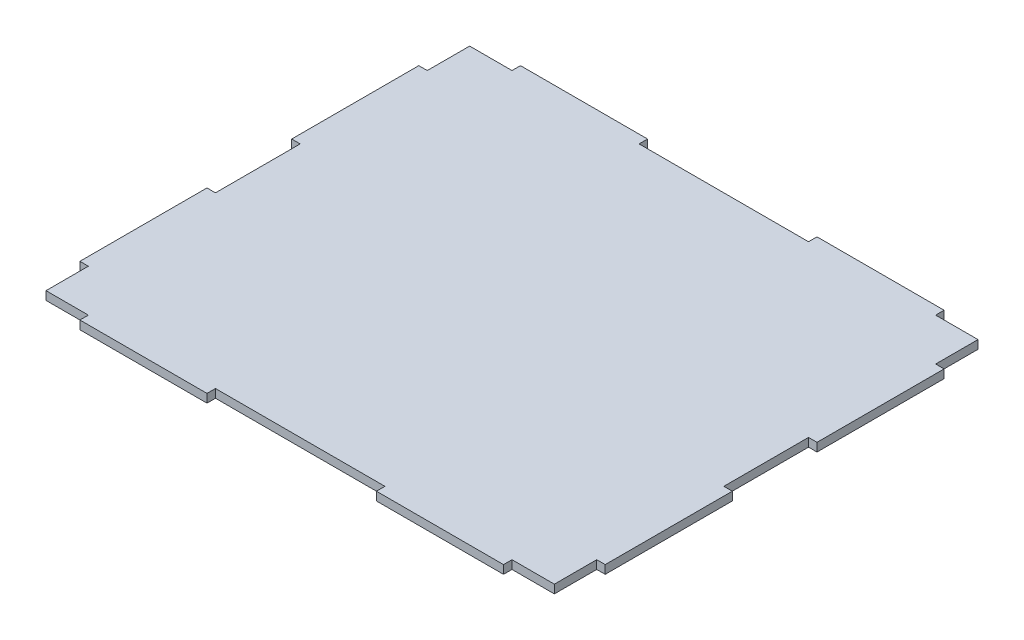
ISO-10303-21;
HEADER;
FILE_DESCRIPTION(('STEP AP214'),'2;1');
FILE_NAME('part.step','',(''),(''),'','','');
FILE_SCHEMA(('AUTOMOTIVE_DESIGN { 1 0 10303 214 1 1 1 1 }'));
ENDSEC;
DATA;
#1=APPLICATION_CONTEXT('core data for automotive mechanical design processes');
#2=APPLICATION_PROTOCOL_DEFINITION('international standard','automotive_design',2000,#1);
#3=PRODUCT_CONTEXT('',#1,'mechanical');
#4=PRODUCT('Part','Part','',(#3));
#5=PRODUCT_RELATED_PRODUCT_CATEGORY('part','',(#4));
#6=PRODUCT_DEFINITION_FORMATION('','',#4);
#7=PRODUCT_DEFINITION_CONTEXT('part definition',#1,'design');
#8=PRODUCT_DEFINITION('design','',#6,#7);
#9=PRODUCT_DEFINITION_SHAPE('','',#8);
#10=(LENGTH_UNIT() NAMED_UNIT(*) SI_UNIT(.MILLI.,.METRE.));
#11=(NAMED_UNIT(*) PLANE_ANGLE_UNIT() SI_UNIT($,.RADIAN.));
#12=(NAMED_UNIT(*) SI_UNIT($,.STERADIAN.) SOLID_ANGLE_UNIT());
#13=UNCERTAINTY_MEASURE_WITH_UNIT(LENGTH_MEASURE(1.E-05),#10,'distance_accuracy_value','');
#14=(GEOMETRIC_REPRESENTATION_CONTEXT(3) GLOBAL_UNCERTAINTY_ASSIGNED_CONTEXT((#13)) GLOBAL_UNIT_ASSIGNED_CONTEXT((#10,
#11,#12)) REPRESENTATION_CONTEXT('',''));
#15=CARTESIAN_POINT('',(0.,0.,0.));
#16=DIRECTION('',(0.,0.,1.));
#17=DIRECTION('',(1.,0.,0.));
#18=AXIS2_PLACEMENT_3D('',#15,#16,#17);
#19=CARTESIAN_POINT('',(600.,20.,-400.));
#20=DIRECTION('',(-1.,0.,0.));
#21=DIRECTION('',(0.,0.,1.));
#22=AXIS2_PLACEMENT_3D('',#19,#20,#21);
#23=PLANE('',#22);
#24=DIRECTION('',(0.,0.,-1.));
#25=VECTOR('',#24,1.);
#26=CARTESIAN_POINT('',(600.,0.,-400.));
#27=LINE('',#26,#25);
#28=CARTESIAN_POINT('',(600.,0.,-400.));
#29=VERTEX_POINT('',#28);
#30=CARTESIAN_POINT('',(600.,0.,-500.));
#31=VERTEX_POINT('',#30);
#32=EDGE_CURVE('E307',#29,#31,#27,.T.);
#33=ORIENTED_EDGE('',*,*,#32,.T.);
#34=DIRECTION('',(0.,-1.,0.));
#35=VECTOR('',#34,1.);
#36=CARTESIAN_POINT('',(600.,20.,-500.));
#37=LINE('',#36,#35);
#38=CARTESIAN_POINT('',(600.,20.,-500.));
#39=VERTEX_POINT('',#38);
#40=EDGE_CURVE('E11',#39,#31,#37,.T.);
#41=ORIENTED_EDGE('',*,*,#40,.F.);
#42=DIRECTION('',(0.,0.,-1.));
#43=VECTOR('',#42,1.);
#44=CARTESIAN_POINT('',(600.,20.,-400.));
#45=LINE('',#44,#43);
#46=CARTESIAN_POINT('',(600.,20.,-400.));
#47=VERTEX_POINT('',#46);
#48=EDGE_CURVE('E377',#47,#39,#45,.T.);
#49=ORIENTED_EDGE('',*,*,#48,.F.);
#50=DIRECTION('',(0.,-1.,0.));
#51=VECTOR('',#50,1.);
#52=CARTESIAN_POINT('',(600.,20.,-400.));
#53=LINE('',#52,#51);
#54=EDGE_CURVE('E303',#47,#29,#53,.T.);
#55=ORIENTED_EDGE('',*,*,#54,.T.);
#56=EDGE_LOOP('',(#33,#41,#49,#55));
#57=FACE_BOUND('',#56,.T.);
#58=ADVANCED_FACE('F43',(#57),#23,.F.);
#59=CARTESIAN_POINT('',(500.,20.,-500.));
#60=DIRECTION('',(0.,0.,1.));
#61=DIRECTION('',(1.,0.,0.));
#62=AXIS2_PLACEMENT_3D('',#59,#60,#61);
#63=PLANE('',#62);
#64=DIRECTION('',(-1.,0.,0.));
#65=VECTOR('',#64,1.);
#66=CARTESIAN_POINT('',(500.,0.,-500.));
#67=LINE('',#66,#65);
#68=CARTESIAN_POINT('',(500.,0.,-500.));
#69=VERTEX_POINT('',#68);
#70=EDGE_CURVE('E310',#31,#69,#67,.T.);
#71=ORIENTED_EDGE('',*,*,#70,.T.);
#72=DIRECTION('',(0.,-1.,0.));
#73=VECTOR('',#72,1.);
#74=CARTESIAN_POINT('',(500.,20.,-500.));
#75=LINE('',#74,#73);
#76=CARTESIAN_POINT('',(500.,20.,-500.));
#77=VERTEX_POINT('',#76);
#78=EDGE_CURVE('E51',#77,#69,#75,.T.);
#79=ORIENTED_EDGE('',*,*,#78,.F.);
#80=DIRECTION('',(-1.,0.,0.));
#81=VECTOR('',#80,1.);
#82=CARTESIAN_POINT('',(500.,20.,-500.));
#83=LINE('',#82,#81);
#84=EDGE_CURVE('E186',#39,#77,#83,.T.);
#85=ORIENTED_EDGE('',*,*,#84,.F.);
#86=ORIENTED_EDGE('',*,*,#40,.T.);
#87=EDGE_LOOP('',(#71,#79,#85,#86));
#88=FACE_BOUND('',#87,.T.);
#89=ADVANCED_FACE('F575',(#88),#63,.F.);
#90=CARTESIAN_POINT('',(500.,20.,-500.));
#91=DIRECTION('',(-1.,0.,0.));
#92=DIRECTION('',(0.,0.,1.));
#93=AXIS2_PLACEMENT_3D('',#90,#91,#92);
#94=PLANE('',#93);
#95=DIRECTION('',(0.,0.,-1.));
#96=VECTOR('',#95,1.);
#97=CARTESIAN_POINT('',(500.,0.,-500.));
#98=LINE('',#97,#96);
#99=CARTESIAN_POINT('',(500.,0.,-520.));
#100=VERTEX_POINT('',#99);
#101=EDGE_CURVE('E312',#69,#100,#98,.T.);
#102=ORIENTED_EDGE('',*,*,#101,.T.);
#103=DIRECTION('',(0.,-1.,0.));
#104=VECTOR('',#103,1.);
#105=CARTESIAN_POINT('',(500.,20.,-520.));
#106=LINE('',#105,#104);
#107=CARTESIAN_POINT('',(500.,20.,-520.));
#108=VERTEX_POINT('',#107);
#109=EDGE_CURVE('E468',#108,#100,#106,.T.);
#110=ORIENTED_EDGE('',*,*,#109,.F.);
#111=DIRECTION('',(0.,0.,-1.));
#112=VECTOR('',#111,1.);
#113=CARTESIAN_POINT('',(500.,20.,-500.));
#114=LINE('',#113,#112);
#115=EDGE_CURVE('E476',#77,#108,#114,.T.);
#116=ORIENTED_EDGE('',*,*,#115,.F.);
#117=ORIENTED_EDGE('',*,*,#78,.T.);
#118=EDGE_LOOP('',(#102,#110,#116,#117));
#119=FACE_BOUND('',#118,.T.);
#120=ADVANCED_FACE('F474',(#119),#94,.F.);
#121=CARTESIAN_POINT('',(200.,20.,-520.));
#122=DIRECTION('',(0.,0.,1.));
#123=DIRECTION('',(1.,0.,0.));
#124=AXIS2_PLACEMENT_3D('',#121,#122,#123);
#125=PLANE('',#124);
#126=DIRECTION('',(-1.,0.,0.));
#127=VECTOR('',#126,1.);
#128=CARTESIAN_POINT('',(200.,0.,-520.));
#129=LINE('',#128,#127);
#130=CARTESIAN_POINT('',(200.,0.,-520.));
#131=VERTEX_POINT('',#130);
#132=EDGE_CURVE('E314',#100,#131,#129,.T.);
#133=ORIENTED_EDGE('',*,*,#132,.T.);
#134=DIRECTION('',(0.,-1.,0.));
#135=VECTOR('',#134,1.);
#136=CARTESIAN_POINT('',(200.,20.,-520.));
#137=LINE('',#136,#135);
#138=CARTESIAN_POINT('',(200.,20.,-520.));
#139=VERTEX_POINT('',#138);
#140=EDGE_CURVE('E465',#139,#131,#137,.T.);
#141=ORIENTED_EDGE('',*,*,#140,.F.);
#142=DIRECTION('',(-1.,0.,0.));
#143=VECTOR('',#142,1.);
#144=CARTESIAN_POINT('',(200.,20.,-520.));
#145=LINE('',#144,#143);
#146=EDGE_CURVE('E494',#108,#139,#145,.T.);
#147=ORIENTED_EDGE('',*,*,#146,.F.);
#148=ORIENTED_EDGE('',*,*,#109,.T.);
#149=EDGE_LOOP('',(#133,#141,#147,#148));
#150=FACE_BOUND('',#149,.T.);
#151=ADVANCED_FACE('F485',(#150),#125,.F.);
#152=CARTESIAN_POINT('',(200.,20.,-500.));
#153=DIRECTION('',(1.,0.,0.));
#154=DIRECTION('',(0.,0.,-1.));
#155=AXIS2_PLACEMENT_3D('',#152,#153,#154);
#156=PLANE('',#155);
#157=DIRECTION('',(0.,0.,1.));
#158=VECTOR('',#157,1.);
#159=CARTESIAN_POINT('',(200.,0.,-500.));
#160=LINE('',#159,#158);
#161=CARTESIAN_POINT('',(200.,0.,-500.));
#162=VERTEX_POINT('',#161);
#163=EDGE_CURVE('E316',#131,#162,#160,.T.);
#164=ORIENTED_EDGE('',*,*,#163,.T.);
#165=DIRECTION('',(0.,-1.,0.));
#166=VECTOR('',#165,1.);
#167=CARTESIAN_POINT('',(200.,20.,-500.));
#168=LINE('',#167,#166);
#169=CARTESIAN_POINT('',(200.,20.,-500.));
#170=VERTEX_POINT('',#169);
#171=EDGE_CURVE('E462',#170,#162,#168,.T.);
#172=ORIENTED_EDGE('',*,*,#171,.F.);
#173=DIRECTION('',(0.,0.,1.));
#174=VECTOR('',#173,1.);
#175=CARTESIAN_POINT('',(200.,20.,-500.));
#176=LINE('',#175,#174);
#177=EDGE_CURVE('E491',#139,#170,#176,.T.);
#178=ORIENTED_EDGE('',*,*,#177,.F.);
#179=ORIENTED_EDGE('',*,*,#140,.T.);
#180=EDGE_LOOP('',(#164,#172,#178,#179));
#181=FACE_BOUND('',#180,.T.);
#182=ADVANCED_FACE('F489',(#181),#156,.F.);
#183=CARTESIAN_POINT('',(-200.,20.,-500.));
#184=DIRECTION('',(0.,0.,1.));
#185=DIRECTION('',(1.,0.,0.));
#186=AXIS2_PLACEMENT_3D('',#183,#184,#185);
#187=PLANE('',#186);
#188=DIRECTION('',(-1.,0.,0.));
#189=VECTOR('',#188,1.);
#190=CARTESIAN_POINT('',(-200.,0.,-500.));
#191=LINE('',#190,#189);
#192=CARTESIAN_POINT('',(-200.,0.,-500.));
#193=VERTEX_POINT('',#192);
#194=EDGE_CURVE('E318',#162,#193,#191,.T.);
#195=ORIENTED_EDGE('',*,*,#194,.T.);
#196=DIRECTION('',(0.,-1.,0.));
#197=VECTOR('',#196,1.);
#198=CARTESIAN_POINT('',(-200.,20.,-500.));
#199=LINE('',#198,#197);
#200=CARTESIAN_POINT('',(-200.,20.,-500.));
#201=VERTEX_POINT('',#200);
#202=EDGE_CURVE('E459',#201,#193,#199,.T.);
#203=ORIENTED_EDGE('',*,*,#202,.F.);
#204=DIRECTION('',(-1.,0.,0.));
#205=VECTOR('',#204,1.);
#206=CARTESIAN_POINT('',(-200.,20.,-500.));
#207=LINE('',#206,#205);
#208=EDGE_CURVE('E493',#170,#201,#207,.T.);
#209=ORIENTED_EDGE('',*,*,#208,.F.);
#210=ORIENTED_EDGE('',*,*,#171,.T.);
#211=EDGE_LOOP('',(#195,#203,#209,#210));
#212=FACE_BOUND('',#211,.T.);
#213=ADVANCED_FACE('F588',(#212),#187,.F.);
#214=CARTESIAN_POINT('',(-200.,20.,-500.));
#215=DIRECTION('',(-1.,0.,0.));
#216=DIRECTION('',(0.,0.,1.));
#217=AXIS2_PLACEMENT_3D('',#214,#215,#216);
#218=PLANE('',#217);
#219=DIRECTION('',(0.,0.,-1.));
#220=VECTOR('',#219,1.);
#221=CARTESIAN_POINT('',(-200.,0.,-500.));
#222=LINE('',#221,#220);
#223=CARTESIAN_POINT('',(-200.,0.,-520.));
#224=VERTEX_POINT('',#223);
#225=EDGE_CURVE('E320',#193,#224,#222,.T.);
#226=ORIENTED_EDGE('',*,*,#225,.T.);
#227=DIRECTION('',(0.,-1.,0.));
#228=VECTOR('',#227,1.);
#229=CARTESIAN_POINT('',(-200.,20.,-520.));
#230=LINE('',#229,#228);
#231=CARTESIAN_POINT('',(-200.,20.,-520.));
#232=VERTEX_POINT('',#231);
#233=EDGE_CURVE('E456',#232,#224,#230,.T.);
#234=ORIENTED_EDGE('',*,*,#233,.F.);
#235=DIRECTION('',(0.,0.,-1.));
#236=VECTOR('',#235,1.);
#237=CARTESIAN_POINT('',(-200.,20.,-500.));
#238=LINE('',#237,#236);
#239=EDGE_CURVE('E496',#201,#232,#238,.T.);
#240=ORIENTED_EDGE('',*,*,#239,.F.);
#241=ORIENTED_EDGE('',*,*,#202,.T.);
#242=EDGE_LOOP('',(#226,#234,#240,#241));
#243=FACE_BOUND('',#242,.T.);
#244=ADVANCED_FACE('F591',(#243),#218,.F.);
#245=CARTESIAN_POINT('',(-500.,20.,-520.));
#246=DIRECTION('',(0.,0.,1.));
#247=DIRECTION('',(1.,0.,0.));
#248=AXIS2_PLACEMENT_3D('',#245,#246,#247);
#249=PLANE('',#248);
#250=DIRECTION('',(-1.,0.,0.));
#251=VECTOR('',#250,1.);
#252=CARTESIAN_POINT('',(-500.,0.,-520.));
#253=LINE('',#252,#251);
#254=CARTESIAN_POINT('',(-500.,0.,-520.));
#255=VERTEX_POINT('',#254);
#256=EDGE_CURVE('E322',#224,#255,#253,.T.);
#257=ORIENTED_EDGE('',*,*,#256,.T.);
#258=DIRECTION('',(0.,-1.,0.));
#259=VECTOR('',#258,1.);
#260=CARTESIAN_POINT('',(-500.,20.,-520.));
#261=LINE('',#260,#259);
#262=CARTESIAN_POINT('',(-500.,20.,-520.));
#263=VERTEX_POINT('',#262);
#264=EDGE_CURVE('E453',#263,#255,#261,.T.);
#265=ORIENTED_EDGE('',*,*,#264,.F.);
#266=DIRECTION('',(-1.,0.,0.));
#267=VECTOR('',#266,1.);
#268=CARTESIAN_POINT('',(-500.,20.,-520.));
#269=LINE('',#268,#267);
#270=EDGE_CURVE('E502',#232,#263,#269,.T.);
#271=ORIENTED_EDGE('',*,*,#270,.F.);
#272=ORIENTED_EDGE('',*,*,#233,.T.);
#273=EDGE_LOOP('',(#257,#265,#271,#272));
#274=FACE_BOUND('',#273,.T.);
#275=ADVANCED_FACE('F595',(#274),#249,.F.);
#276=CARTESIAN_POINT('',(-500.,20.,-500.));
#277=DIRECTION('',(1.,0.,0.));
#278=DIRECTION('',(0.,0.,-1.));
#279=AXIS2_PLACEMENT_3D('',#276,#277,#278);
#280=PLANE('',#279);
#281=DIRECTION('',(0.,0.,1.));
#282=VECTOR('',#281,1.);
#283=CARTESIAN_POINT('',(-500.,0.,-500.));
#284=LINE('',#283,#282);
#285=CARTESIAN_POINT('',(-500.,0.,-500.));
#286=VERTEX_POINT('',#285);
#287=EDGE_CURVE('E324',#255,#286,#284,.T.);
#288=ORIENTED_EDGE('',*,*,#287,.T.);
#289=DIRECTION('',(0.,-1.,0.));
#290=VECTOR('',#289,1.);
#291=CARTESIAN_POINT('',(-500.,20.,-500.));
#292=LINE('',#291,#290);
#293=CARTESIAN_POINT('',(-500.,20.,-500.));
#294=VERTEX_POINT('',#293);
#295=EDGE_CURVE('E450',#294,#286,#292,.T.);
#296=ORIENTED_EDGE('',*,*,#295,.F.);
#297=DIRECTION('',(0.,0.,1.));
#298=VECTOR('',#297,1.);
#299=CARTESIAN_POINT('',(-500.,20.,-500.));
#300=LINE('',#299,#298);
#301=EDGE_CURVE('E504',#263,#294,#300,.T.);
#302=ORIENTED_EDGE('',*,*,#301,.F.);
#303=ORIENTED_EDGE('',*,*,#264,.T.);
#304=EDGE_LOOP('',(#288,#296,#302,#303));
#305=FACE_BOUND('',#304,.T.);
#306=ADVANCED_FACE('F599',(#305),#280,.F.);
#307=CARTESIAN_POINT('',(-600.,20.,-500.));
#308=DIRECTION('',(0.,0.,1.));
#309=DIRECTION('',(1.,0.,0.));
#310=AXIS2_PLACEMENT_3D('',#307,#308,#309);
#311=PLANE('',#310);
#312=DIRECTION('',(-1.,0.,0.));
#313=VECTOR('',#312,1.);
#314=CARTESIAN_POINT('',(-600.,0.,-500.));
#315=LINE('',#314,#313);
#316=CARTESIAN_POINT('',(-600.,0.,-500.));
#317=VERTEX_POINT('',#316);
#318=EDGE_CURVE('E326',#286,#317,#315,.T.);
#319=ORIENTED_EDGE('',*,*,#318,.T.);
#320=DIRECTION('',(0.,-1.,0.));
#321=VECTOR('',#320,1.);
#322=CARTESIAN_POINT('',(-600.,20.,-500.));
#323=LINE('',#322,#321);
#324=CARTESIAN_POINT('',(-600.,20.,-500.));
#325=VERTEX_POINT('',#324);
#326=EDGE_CURVE('E447',#325,#317,#323,.T.);
#327=ORIENTED_EDGE('',*,*,#326,.F.);
#328=DIRECTION('',(-1.,0.,0.));
#329=VECTOR('',#328,1.);
#330=CARTESIAN_POINT('',(-600.,20.,-500.));
#331=LINE('',#330,#329);
#332=EDGE_CURVE('E506',#294,#325,#331,.T.);
#333=ORIENTED_EDGE('',*,*,#332,.F.);
#334=ORIENTED_EDGE('',*,*,#295,.T.);
#335=EDGE_LOOP('',(#319,#327,#333,#334));
#336=FACE_BOUND('',#335,.T.);
#337=ADVANCED_FACE('F603',(#336),#311,.F.);
#338=CARTESIAN_POINT('',(-600.,20.,-400.));
#339=DIRECTION('',(1.,0.,0.));
#340=DIRECTION('',(0.,0.,-1.));
#341=AXIS2_PLACEMENT_3D('',#338,#339,#340);
#342=PLANE('',#341);
#343=DIRECTION('',(0.,0.,1.));
#344=VECTOR('',#343,1.);
#345=CARTESIAN_POINT('',(-600.,0.,-400.));
#346=LINE('',#345,#344);
#347=CARTESIAN_POINT('',(-600.,0.,-400.));
#348=VERTEX_POINT('',#347);
#349=EDGE_CURVE('E328',#317,#348,#346,.T.);
#350=ORIENTED_EDGE('',*,*,#349,.T.);
#351=DIRECTION('',(0.,-1.,0.));
#352=VECTOR('',#351,1.);
#353=CARTESIAN_POINT('',(-600.,20.,-400.));
#354=LINE('',#353,#352);
#355=CARTESIAN_POINT('',(-600.,20.,-400.));
#356=VERTEX_POINT('',#355);
#357=EDGE_CURVE('E444',#356,#348,#354,.T.);
#358=ORIENTED_EDGE('',*,*,#357,.F.);
#359=DIRECTION('',(0.,0.,1.));
#360=VECTOR('',#359,1.);
#361=CARTESIAN_POINT('',(-600.,20.,-400.));
#362=LINE('',#361,#360);
#363=EDGE_CURVE('E508',#325,#356,#362,.T.);
#364=ORIENTED_EDGE('',*,*,#363,.F.);
#365=ORIENTED_EDGE('',*,*,#326,.T.);
#366=EDGE_LOOP('',(#350,#358,#364,#365));
#367=FACE_BOUND('',#366,.T.);
#368=ADVANCED_FACE('F607',(#367),#342,.F.);
#369=CARTESIAN_POINT('',(-600.,20.,-400.));
#370=DIRECTION('',(0.,0.,1.));
#371=DIRECTION('',(1.,0.,0.));
#372=AXIS2_PLACEMENT_3D('',#369,#370,#371);
#373=PLANE('',#372);
#374=DIRECTION('',(-1.,0.,0.));
#375=VECTOR('',#374,1.);
#376=CARTESIAN_POINT('',(-600.,0.,-400.));
#377=LINE('',#376,#375);
#378=CARTESIAN_POINT('',(-620.,0.,-400.));
#379=VERTEX_POINT('',#378);
#380=EDGE_CURVE('E330',#348,#379,#377,.T.);
#381=ORIENTED_EDGE('',*,*,#380,.T.);
#382=DIRECTION('',(0.,-1.,0.));
#383=VECTOR('',#382,1.);
#384=CARTESIAN_POINT('',(-620.,20.,-400.));
#385=LINE('',#384,#383);
#386=CARTESIAN_POINT('',(-620.,20.,-400.));
#387=VERTEX_POINT('',#386);
#388=EDGE_CURVE('E441',#387,#379,#385,.T.);
#389=ORIENTED_EDGE('',*,*,#388,.F.);
#390=DIRECTION('',(-1.,0.,0.));
#391=VECTOR('',#390,1.);
#392=CARTESIAN_POINT('',(-600.,20.,-400.));
#393=LINE('',#392,#391);
#394=EDGE_CURVE('E510',#356,#387,#393,.T.);
#395=ORIENTED_EDGE('',*,*,#394,.F.);
#396=ORIENTED_EDGE('',*,*,#357,.T.);
#397=EDGE_LOOP('',(#381,#389,#395,#396));
#398=FACE_BOUND('',#397,.T.);
#399=ADVANCED_FACE('F611',(#398),#373,.F.);
#400=CARTESIAN_POINT('',(-620.,20.,-400.));
#401=DIRECTION('',(1.,0.,0.));
#402=DIRECTION('',(0.,0.,-1.));
#403=AXIS2_PLACEMENT_3D('',#400,#401,#402);
#404=PLANE('',#403);
#405=DIRECTION('',(0.,0.,1.));
#406=VECTOR('',#405,1.);
#407=CARTESIAN_POINT('',(-620.,0.,-400.));
#408=LINE('',#407,#406);
#409=CARTESIAN_POINT('',(-620.,0.,-100.));
#410=VERTEX_POINT('',#409);
#411=EDGE_CURVE('E332',#379,#410,#408,.T.);
#412=ORIENTED_EDGE('',*,*,#411,.T.);
#413=DIRECTION('',(0.,-1.,0.));
#414=VECTOR('',#413,1.);
#415=CARTESIAN_POINT('',(-620.,20.,-100.));
#416=LINE('',#415,#414);
#417=CARTESIAN_POINT('',(-620.,20.,-100.));
#418=VERTEX_POINT('',#417);
#419=EDGE_CURVE('E438',#418,#410,#416,.T.);
#420=ORIENTED_EDGE('',*,*,#419,.F.);
#421=DIRECTION('',(0.,0.,1.));
#422=VECTOR('',#421,1.);
#423=CARTESIAN_POINT('',(-620.,20.,-400.));
#424=LINE('',#423,#422);
#425=EDGE_CURVE('E512',#387,#418,#424,.T.);
#426=ORIENTED_EDGE('',*,*,#425,.F.);
#427=ORIENTED_EDGE('',*,*,#388,.T.);
#428=EDGE_LOOP('',(#412,#420,#426,#427));
#429=FACE_BOUND('',#428,.T.);
#430=ADVANCED_FACE('F615',(#429),#404,.F.);
#431=CARTESIAN_POINT('',(-600.,20.,-100.));
#432=DIRECTION('',(0.,0.,-1.));
#433=DIRECTION('',(-1.,0.,0.));
#434=AXIS2_PLACEMENT_3D('',#431,#432,#433);
#435=PLANE('',#434);
#436=DIRECTION('',(1.,0.,0.));
#437=VECTOR('',#436,1.);
#438=CARTESIAN_POINT('',(-600.,0.,-100.));
#439=LINE('',#438,#437);
#440=CARTESIAN_POINT('',(-600.,0.,-100.));
#441=VERTEX_POINT('',#440);
#442=EDGE_CURVE('E334',#410,#441,#439,.T.);
#443=ORIENTED_EDGE('',*,*,#442,.T.);
#444=DIRECTION('',(0.,-1.,0.));
#445=VECTOR('',#444,1.);
#446=CARTESIAN_POINT('',(-600.,20.,-100.));
#447=LINE('',#446,#445);
#448=CARTESIAN_POINT('',(-600.,20.,-100.));
#449=VERTEX_POINT('',#448);
#450=EDGE_CURVE('E435',#449,#441,#447,.T.);
#451=ORIENTED_EDGE('',*,*,#450,.F.);
#452=DIRECTION('',(1.,0.,0.));
#453=VECTOR('',#452,1.);
#454=CARTESIAN_POINT('',(-600.,20.,-100.));
#455=LINE('',#454,#453);
#456=EDGE_CURVE('E514',#418,#449,#455,.T.);
#457=ORIENTED_EDGE('',*,*,#456,.F.);
#458=ORIENTED_EDGE('',*,*,#419,.T.);
#459=EDGE_LOOP('',(#443,#451,#457,#458));
#460=FACE_BOUND('',#459,.T.);
#461=ADVANCED_FACE('F619',(#460),#435,.F.);
#462=CARTESIAN_POINT('',(-600.,20.,100.));
#463=DIRECTION('',(1.,0.,0.));
#464=DIRECTION('',(0.,0.,-1.));
#465=AXIS2_PLACEMENT_3D('',#462,#463,#464);
#466=PLANE('',#465);
#467=DIRECTION('',(0.,0.,1.));
#468=VECTOR('',#467,1.);
#469=CARTESIAN_POINT('',(-600.,0.,100.));
#470=LINE('',#469,#468);
#471=CARTESIAN_POINT('',(-600.,0.,100.));
#472=VERTEX_POINT('',#471);
#473=EDGE_CURVE('E336',#441,#472,#470,.T.);
#474=ORIENTED_EDGE('',*,*,#473,.T.);
#475=DIRECTION('',(0.,-1.,0.));
#476=VECTOR('',#475,1.);
#477=CARTESIAN_POINT('',(-600.,20.,100.));
#478=LINE('',#477,#476);
#479=CARTESIAN_POINT('',(-600.,20.,100.));
#480=VERTEX_POINT('',#479);
#481=EDGE_CURVE('E432',#480,#472,#478,.T.);
#482=ORIENTED_EDGE('',*,*,#481,.F.);
#483=DIRECTION('',(0.,0.,1.));
#484=VECTOR('',#483,1.);
#485=CARTESIAN_POINT('',(-600.,20.,100.));
#486=LINE('',#485,#484);
#487=EDGE_CURVE('E516',#449,#480,#486,.T.);
#488=ORIENTED_EDGE('',*,*,#487,.F.);
#489=ORIENTED_EDGE('',*,*,#450,.T.);
#490=EDGE_LOOP('',(#474,#482,#488,#489));
#491=FACE_BOUND('',#490,.T.);
#492=ADVANCED_FACE('F623',(#491),#466,.F.);
#493=CARTESIAN_POINT('',(-600.,20.,100.));
#494=DIRECTION('',(0.,0.,1.));
#495=DIRECTION('',(1.,0.,0.));
#496=AXIS2_PLACEMENT_3D('',#493,#494,#495);
#497=PLANE('',#496);
#498=DIRECTION('',(-1.,0.,0.));
#499=VECTOR('',#498,1.);
#500=CARTESIAN_POINT('',(-600.,0.,100.));
#501=LINE('',#500,#499);
#502=CARTESIAN_POINT('',(-620.,0.,100.));
#503=VERTEX_POINT('',#502);
#504=EDGE_CURVE('E338',#472,#503,#501,.T.);
#505=ORIENTED_EDGE('',*,*,#504,.T.);
#506=DIRECTION('',(0.,-1.,0.));
#507=VECTOR('',#506,1.);
#508=CARTESIAN_POINT('',(-620.,20.,100.));
#509=LINE('',#508,#507);
#510=CARTESIAN_POINT('',(-620.,20.,100.));
#511=VERTEX_POINT('',#510);
#512=EDGE_CURVE('E429',#511,#503,#509,.T.);
#513=ORIENTED_EDGE('',*,*,#512,.F.);
#514=DIRECTION('',(-1.,0.,0.));
#515=VECTOR('',#514,1.);
#516=CARTESIAN_POINT('',(-600.,20.,100.));
#517=LINE('',#516,#515);
#518=EDGE_CURVE('E518',#480,#511,#517,.T.);
#519=ORIENTED_EDGE('',*,*,#518,.F.);
#520=ORIENTED_EDGE('',*,*,#481,.T.);
#521=EDGE_LOOP('',(#505,#513,#519,#520));
#522=FACE_BOUND('',#521,.T.);
#523=ADVANCED_FACE('F627',(#522),#497,.F.);
#524=CARTESIAN_POINT('',(-620.,20.,100.));
#525=DIRECTION('',(1.,0.,0.));
#526=DIRECTION('',(0.,0.,-1.));
#527=AXIS2_PLACEMENT_3D('',#524,#525,#526);
#528=PLANE('',#527);
#529=DIRECTION('',(0.,0.,1.));
#530=VECTOR('',#529,1.);
#531=CARTESIAN_POINT('',(-620.,0.,100.));
#532=LINE('',#531,#530);
#533=CARTESIAN_POINT('',(-620.,0.,400.));
#534=VERTEX_POINT('',#533);
#535=EDGE_CURVE('E340',#503,#534,#532,.T.);
#536=ORIENTED_EDGE('',*,*,#535,.T.);
#537=DIRECTION('',(0.,-1.,0.));
#538=VECTOR('',#537,1.);
#539=CARTESIAN_POINT('',(-620.,20.,400.));
#540=LINE('',#539,#538);
#541=CARTESIAN_POINT('',(-620.,20.,400.));
#542=VERTEX_POINT('',#541);
#543=EDGE_CURVE('E426',#542,#534,#540,.T.);
#544=ORIENTED_EDGE('',*,*,#543,.F.);
#545=DIRECTION('',(0.,0.,1.));
#546=VECTOR('',#545,1.);
#547=CARTESIAN_POINT('',(-620.,20.,100.));
#548=LINE('',#547,#546);
#549=EDGE_CURVE('E520',#511,#542,#548,.T.);
#550=ORIENTED_EDGE('',*,*,#549,.F.);
#551=ORIENTED_EDGE('',*,*,#512,.T.);
#552=EDGE_LOOP('',(#536,#544,#550,#551));
#553=FACE_BOUND('',#552,.T.);
#554=ADVANCED_FACE('F631',(#553),#528,.F.);
#555=CARTESIAN_POINT('',(-600.,20.,400.));
#556=DIRECTION('',(0.,0.,-1.));
#557=DIRECTION('',(-1.,0.,0.));
#558=AXIS2_PLACEMENT_3D('',#555,#556,#557);
#559=PLANE('',#558);
#560=DIRECTION('',(1.,0.,0.));
#561=VECTOR('',#560,1.);
#562=CARTESIAN_POINT('',(-600.,0.,400.));
#563=LINE('',#562,#561);
#564=CARTESIAN_POINT('',(-600.,0.,400.));
#565=VERTEX_POINT('',#564);
#566=EDGE_CURVE('E342',#534,#565,#563,.T.);
#567=ORIENTED_EDGE('',*,*,#566,.T.);
#568=DIRECTION('',(0.,-1.,0.));
#569=VECTOR('',#568,1.);
#570=CARTESIAN_POINT('',(-600.,20.,400.));
#571=LINE('',#570,#569);
#572=CARTESIAN_POINT('',(-600.,20.,400.));
#573=VERTEX_POINT('',#572);
#574=EDGE_CURVE('E423',#573,#565,#571,.T.);
#575=ORIENTED_EDGE('',*,*,#574,.F.);
#576=DIRECTION('',(1.,0.,0.));
#577=VECTOR('',#576,1.);
#578=CARTESIAN_POINT('',(-600.,20.,400.));
#579=LINE('',#578,#577);
#580=EDGE_CURVE('E522',#542,#573,#579,.T.);
#581=ORIENTED_EDGE('',*,*,#580,.F.);
#582=ORIENTED_EDGE('',*,*,#543,.T.);
#583=EDGE_LOOP('',(#567,#575,#581,#582));
#584=FACE_BOUND('',#583,.T.);
#585=ADVANCED_FACE('F635',(#584),#559,.F.);
#586=CARTESIAN_POINT('',(-600.,20.,500.));
#587=DIRECTION('',(1.,0.,0.));
#588=DIRECTION('',(0.,0.,-1.));
#589=AXIS2_PLACEMENT_3D('',#586,#587,#588);
#590=PLANE('',#589);
#591=DIRECTION('',(0.,0.,1.));
#592=VECTOR('',#591,1.);
#593=CARTESIAN_POINT('',(-600.,0.,500.));
#594=LINE('',#593,#592);
#595=CARTESIAN_POINT('',(-600.,0.,500.));
#596=VERTEX_POINT('',#595);
#597=EDGE_CURVE('E344',#565,#596,#594,.T.);
#598=ORIENTED_EDGE('',*,*,#597,.T.);
#599=DIRECTION('',(0.,-1.,0.));
#600=VECTOR('',#599,1.);
#601=CARTESIAN_POINT('',(-600.,20.,500.));
#602=LINE('',#601,#600);
#603=CARTESIAN_POINT('',(-600.,20.,500.));
#604=VERTEX_POINT('',#603);
#605=EDGE_CURVE('E420',#604,#596,#602,.T.);
#606=ORIENTED_EDGE('',*,*,#605,.F.);
#607=DIRECTION('',(0.,0.,1.));
#608=VECTOR('',#607,1.);
#609=CARTESIAN_POINT('',(-600.,20.,500.));
#610=LINE('',#609,#608);
#611=EDGE_CURVE('E524',#573,#604,#610,.T.);
#612=ORIENTED_EDGE('',*,*,#611,.F.);
#613=ORIENTED_EDGE('',*,*,#574,.T.);
#614=EDGE_LOOP('',(#598,#606,#612,#613));
#615=FACE_BOUND('',#614,.T.);
#616=ADVANCED_FACE('F639',(#615),#590,.F.);
#617=CARTESIAN_POINT('',(-600.,20.,500.));
#618=DIRECTION('',(0.,0.,-1.));
#619=DIRECTION('',(-1.,0.,0.));
#620=AXIS2_PLACEMENT_3D('',#617,#618,#619);
#621=PLANE('',#620);
#622=DIRECTION('',(1.,0.,0.));
#623=VECTOR('',#622,1.);
#624=CARTESIAN_POINT('',(-600.,0.,500.));
#625=LINE('',#624,#623);
#626=CARTESIAN_POINT('',(-500.,0.,500.));
#627=VERTEX_POINT('',#626);
#628=EDGE_CURVE('E346',#596,#627,#625,.T.);
#629=ORIENTED_EDGE('',*,*,#628,.T.);
#630=DIRECTION('',(0.,-1.,0.));
#631=VECTOR('',#630,1.);
#632=CARTESIAN_POINT('',(-500.,20.,500.));
#633=LINE('',#632,#631);
#634=CARTESIAN_POINT('',(-500.,20.,500.));
#635=VERTEX_POINT('',#634);
#636=EDGE_CURVE('E417',#635,#627,#633,.T.);
#637=ORIENTED_EDGE('',*,*,#636,.F.);
#638=DIRECTION('',(1.,0.,0.));
#639=VECTOR('',#638,1.);
#640=CARTESIAN_POINT('',(-600.,20.,500.));
#641=LINE('',#640,#639);
#642=EDGE_CURVE('E526',#604,#635,#641,.T.);
#643=ORIENTED_EDGE('',*,*,#642,.F.);
#644=ORIENTED_EDGE('',*,*,#605,.T.);
#645=EDGE_LOOP('',(#629,#637,#643,#644));
#646=FACE_BOUND('',#645,.T.);
#647=ADVANCED_FACE('F643',(#646),#621,.F.);
#648=CARTESIAN_POINT('',(-500.,20.,500.));
#649=DIRECTION('',(1.,0.,0.));
#650=DIRECTION('',(0.,0.,-1.));
#651=AXIS2_PLACEMENT_3D('',#648,#649,#650);
#652=PLANE('',#651);
#653=DIRECTION('',(0.,0.,1.));
#654=VECTOR('',#653,1.);
#655=CARTESIAN_POINT('',(-500.,0.,500.));
#656=LINE('',#655,#654);
#657=CARTESIAN_POINT('',(-500.,0.,520.));
#658=VERTEX_POINT('',#657);
#659=EDGE_CURVE('E348',#627,#658,#656,.T.);
#660=ORIENTED_EDGE('',*,*,#659,.T.);
#661=DIRECTION('',(0.,-1.,0.));
#662=VECTOR('',#661,1.);
#663=CARTESIAN_POINT('',(-500.,20.,520.));
#664=LINE('',#663,#662);
#665=CARTESIAN_POINT('',(-500.,20.,520.));
#666=VERTEX_POINT('',#665);
#667=EDGE_CURVE('E414',#666,#658,#664,.T.);
#668=ORIENTED_EDGE('',*,*,#667,.F.);
#669=DIRECTION('',(0.,0.,1.));
#670=VECTOR('',#669,1.);
#671=CARTESIAN_POINT('',(-500.,20.,500.));
#672=LINE('',#671,#670);
#673=EDGE_CURVE('E528',#635,#666,#672,.T.);
#674=ORIENTED_EDGE('',*,*,#673,.F.);
#675=ORIENTED_EDGE('',*,*,#636,.T.);
#676=EDGE_LOOP('',(#660,#668,#674,#675));
#677=FACE_BOUND('',#676,.T.);
#678=ADVANCED_FACE('F647',(#677),#652,.F.);
#679=CARTESIAN_POINT('',(-500.,20.,520.));
#680=DIRECTION('',(0.,0.,-1.));
#681=DIRECTION('',(-1.,0.,0.));
#682=AXIS2_PLACEMENT_3D('',#679,#680,#681);
#683=PLANE('',#682);
#684=DIRECTION('',(1.,0.,0.));
#685=VECTOR('',#684,1.);
#686=CARTESIAN_POINT('',(-500.,0.,520.));
#687=LINE('',#686,#685);
#688=CARTESIAN_POINT('',(-200.,0.,520.));
#689=VERTEX_POINT('',#688);
#690=EDGE_CURVE('E350',#658,#689,#687,.T.);
#691=ORIENTED_EDGE('',*,*,#690,.T.);
#692=DIRECTION('',(0.,-1.,0.));
#693=VECTOR('',#692,1.);
#694=CARTESIAN_POINT('',(-200.,20.,520.));
#695=LINE('',#694,#693);
#696=CARTESIAN_POINT('',(-200.,20.,520.));
#697=VERTEX_POINT('',#696);
#698=EDGE_CURVE('E411',#697,#689,#695,.T.);
#699=ORIENTED_EDGE('',*,*,#698,.F.);
#700=DIRECTION('',(1.,0.,0.));
#701=VECTOR('',#700,1.);
#702=CARTESIAN_POINT('',(-500.,20.,520.));
#703=LINE('',#702,#701);
#704=EDGE_CURVE('E530',#666,#697,#703,.T.);
#705=ORIENTED_EDGE('',*,*,#704,.F.);
#706=ORIENTED_EDGE('',*,*,#667,.T.);
#707=EDGE_LOOP('',(#691,#699,#705,#706));
#708=FACE_BOUND('',#707,.T.);
#709=ADVANCED_FACE('F651',(#708),#683,.F.);
#710=CARTESIAN_POINT('',(-200.,20.,500.));
#711=DIRECTION('',(-1.,0.,0.));
#712=DIRECTION('',(0.,0.,1.));
#713=AXIS2_PLACEMENT_3D('',#710,#711,#712);
#714=PLANE('',#713);
#715=DIRECTION('',(0.,0.,-1.));
#716=VECTOR('',#715,1.);
#717=CARTESIAN_POINT('',(-200.,0.,500.));
#718=LINE('',#717,#716);
#719=CARTESIAN_POINT('',(-200.,0.,500.));
#720=VERTEX_POINT('',#719);
#721=EDGE_CURVE('E352',#689,#720,#718,.T.);
#722=ORIENTED_EDGE('',*,*,#721,.T.);
#723=DIRECTION('',(0.,-1.,0.));
#724=VECTOR('',#723,1.);
#725=CARTESIAN_POINT('',(-200.,20.,500.));
#726=LINE('',#725,#724);
#727=CARTESIAN_POINT('',(-200.,20.,500.));
#728=VERTEX_POINT('',#727);
#729=EDGE_CURVE('E408',#728,#720,#726,.T.);
#730=ORIENTED_EDGE('',*,*,#729,.F.);
#731=DIRECTION('',(0.,0.,-1.));
#732=VECTOR('',#731,1.);
#733=CARTESIAN_POINT('',(-200.,20.,500.));
#734=LINE('',#733,#732);
#735=EDGE_CURVE('E532',#697,#728,#734,.T.);
#736=ORIENTED_EDGE('',*,*,#735,.F.);
#737=ORIENTED_EDGE('',*,*,#698,.T.);
#738=EDGE_LOOP('',(#722,#730,#736,#737));
#739=FACE_BOUND('',#738,.T.);
#740=ADVANCED_FACE('F655',(#739),#714,.F.);
#741=CARTESIAN_POINT('',(-200.,20.,500.));
#742=DIRECTION('',(0.,0.,-1.));
#743=DIRECTION('',(-1.,0.,0.));
#744=AXIS2_PLACEMENT_3D('',#741,#742,#743);
#745=PLANE('',#744);
#746=DIRECTION('',(1.,0.,0.));
#747=VECTOR('',#746,1.);
#748=CARTESIAN_POINT('',(-200.,0.,500.));
#749=LINE('',#748,#747);
#750=CARTESIAN_POINT('',(200.,0.,500.));
#751=VERTEX_POINT('',#750);
#752=EDGE_CURVE('E354',#720,#751,#749,.T.);
#753=ORIENTED_EDGE('',*,*,#752,.T.);
#754=DIRECTION('',(0.,-1.,0.));
#755=VECTOR('',#754,1.);
#756=CARTESIAN_POINT('',(200.,20.,500.));
#757=LINE('',#756,#755);
#758=CARTESIAN_POINT('',(200.,20.,500.));
#759=VERTEX_POINT('',#758);
#760=EDGE_CURVE('E405',#759,#751,#757,.T.);
#761=ORIENTED_EDGE('',*,*,#760,.F.);
#762=DIRECTION('',(1.,0.,0.));
#763=VECTOR('',#762,1.);
#764=CARTESIAN_POINT('',(-200.,20.,500.));
#765=LINE('',#764,#763);
#766=EDGE_CURVE('E534',#728,#759,#765,.T.);
#767=ORIENTED_EDGE('',*,*,#766,.F.);
#768=ORIENTED_EDGE('',*,*,#729,.T.);
#769=EDGE_LOOP('',(#753,#761,#767,#768));
#770=FACE_BOUND('',#769,.T.);
#771=ADVANCED_FACE('F659',(#770),#745,.F.);
#772=CARTESIAN_POINT('',(200.,20.,500.));
#773=DIRECTION('',(1.,0.,0.));
#774=DIRECTION('',(0.,0.,-1.));
#775=AXIS2_PLACEMENT_3D('',#772,#773,#774);
#776=PLANE('',#775);
#777=DIRECTION('',(0.,0.,1.));
#778=VECTOR('',#777,1.);
#779=CARTESIAN_POINT('',(200.,0.,500.));
#780=LINE('',#779,#778);
#781=CARTESIAN_POINT('',(200.,0.,520.));
#782=VERTEX_POINT('',#781);
#783=EDGE_CURVE('E356',#751,#782,#780,.T.);
#784=ORIENTED_EDGE('',*,*,#783,.T.);
#785=DIRECTION('',(0.,-1.,0.));
#786=VECTOR('',#785,1.);
#787=CARTESIAN_POINT('',(200.,20.,520.));
#788=LINE('',#787,#786);
#789=CARTESIAN_POINT('',(200.,20.,520.));
#790=VERTEX_POINT('',#789);
#791=EDGE_CURVE('E402',#790,#782,#788,.T.);
#792=ORIENTED_EDGE('',*,*,#791,.F.);
#793=DIRECTION('',(0.,0.,1.));
#794=VECTOR('',#793,1.);
#795=CARTESIAN_POINT('',(200.,20.,500.));
#796=LINE('',#795,#794);
#797=EDGE_CURVE('E536',#759,#790,#796,.T.);
#798=ORIENTED_EDGE('',*,*,#797,.F.);
#799=ORIENTED_EDGE('',*,*,#760,.T.);
#800=EDGE_LOOP('',(#784,#792,#798,#799));
#801=FACE_BOUND('',#800,.T.);
#802=ADVANCED_FACE('F663',(#801),#776,.F.);
#803=CARTESIAN_POINT('',(200.,20.,520.));
#804=DIRECTION('',(0.,0.,-1.));
#805=DIRECTION('',(-1.,0.,0.));
#806=AXIS2_PLACEMENT_3D('',#803,#804,#805);
#807=PLANE('',#806);
#808=DIRECTION('',(1.,0.,0.));
#809=VECTOR('',#808,1.);
#810=CARTESIAN_POINT('',(200.,0.,520.));
#811=LINE('',#810,#809);
#812=CARTESIAN_POINT('',(500.,0.,520.));
#813=VERTEX_POINT('',#812);
#814=EDGE_CURVE('E358',#782,#813,#811,.T.);
#815=ORIENTED_EDGE('',*,*,#814,.T.);
#816=DIRECTION('',(0.,-1.,0.));
#817=VECTOR('',#816,1.);
#818=CARTESIAN_POINT('',(500.,20.,520.));
#819=LINE('',#818,#817);
#820=CARTESIAN_POINT('',(500.,20.,520.));
#821=VERTEX_POINT('',#820);
#822=EDGE_CURVE('E399',#821,#813,#819,.T.);
#823=ORIENTED_EDGE('',*,*,#822,.F.);
#824=DIRECTION('',(1.,0.,0.));
#825=VECTOR('',#824,1.);
#826=CARTESIAN_POINT('',(200.,20.,520.));
#827=LINE('',#826,#825);
#828=EDGE_CURVE('E538',#790,#821,#827,.T.);
#829=ORIENTED_EDGE('',*,*,#828,.F.);
#830=ORIENTED_EDGE('',*,*,#791,.T.);
#831=EDGE_LOOP('',(#815,#823,#829,#830));
#832=FACE_BOUND('',#831,.T.);
#833=ADVANCED_FACE('F667',(#832),#807,.F.);
#834=CARTESIAN_POINT('',(500.,20.,500.));
#835=DIRECTION('',(-1.,0.,0.));
#836=DIRECTION('',(0.,0.,1.));
#837=AXIS2_PLACEMENT_3D('',#834,#835,#836);
#838=PLANE('',#837);
#839=DIRECTION('',(0.,0.,-1.));
#840=VECTOR('',#839,1.);
#841=CARTESIAN_POINT('',(500.,0.,500.));
#842=LINE('',#841,#840);
#843=CARTESIAN_POINT('',(500.,0.,500.));
#844=VERTEX_POINT('',#843);
#845=EDGE_CURVE('E360',#813,#844,#842,.T.);
#846=ORIENTED_EDGE('',*,*,#845,.T.);
#847=DIRECTION('',(0.,-1.,0.));
#848=VECTOR('',#847,1.);
#849=CARTESIAN_POINT('',(500.,20.,500.));
#850=LINE('',#849,#848);
#851=CARTESIAN_POINT('',(500.,20.,500.));
#852=VERTEX_POINT('',#851);
#853=EDGE_CURVE('E396',#852,#844,#850,.T.);
#854=ORIENTED_EDGE('',*,*,#853,.F.);
#855=DIRECTION('',(0.,0.,-1.));
#856=VECTOR('',#855,1.);
#857=CARTESIAN_POINT('',(500.,20.,500.));
#858=LINE('',#857,#856);
#859=EDGE_CURVE('E540',#821,#852,#858,.T.);
#860=ORIENTED_EDGE('',*,*,#859,.F.);
#861=ORIENTED_EDGE('',*,*,#822,.T.);
#862=EDGE_LOOP('',(#846,#854,#860,#861));
#863=FACE_BOUND('',#862,.T.);
#864=ADVANCED_FACE('F671',(#863),#838,.F.);
#865=CARTESIAN_POINT('',(500.,20.,500.));
#866=DIRECTION('',(0.,0.,-1.));
#867=DIRECTION('',(-1.,0.,0.));
#868=AXIS2_PLACEMENT_3D('',#865,#866,#867);
#869=PLANE('',#868);
#870=DIRECTION('',(1.,0.,0.));
#871=VECTOR('',#870,1.);
#872=CARTESIAN_POINT('',(500.,0.,500.));
#873=LINE('',#872,#871);
#874=CARTESIAN_POINT('',(600.,0.,500.));
#875=VERTEX_POINT('',#874);
#876=EDGE_CURVE('E362',#844,#875,#873,.T.);
#877=ORIENTED_EDGE('',*,*,#876,.T.);
#878=DIRECTION('',(0.,-1.,0.));
#879=VECTOR('',#878,1.);
#880=CARTESIAN_POINT('',(600.,20.,500.));
#881=LINE('',#880,#879);
#882=CARTESIAN_POINT('',(600.,20.,500.));
#883=VERTEX_POINT('',#882);
#884=EDGE_CURVE('E393',#883,#875,#881,.T.);
#885=ORIENTED_EDGE('',*,*,#884,.F.);
#886=DIRECTION('',(1.,0.,0.));
#887=VECTOR('',#886,1.);
#888=CARTESIAN_POINT('',(500.,20.,500.));
#889=LINE('',#888,#887);
#890=EDGE_CURVE('E542',#852,#883,#889,.T.);
#891=ORIENTED_EDGE('',*,*,#890,.F.);
#892=ORIENTED_EDGE('',*,*,#853,.T.);
#893=EDGE_LOOP('',(#877,#885,#891,#892));
#894=FACE_BOUND('',#893,.T.);
#895=ADVANCED_FACE('F675',(#894),#869,.F.);
#896=CARTESIAN_POINT('',(600.,20.,500.));
#897=DIRECTION('',(-1.,0.,0.));
#898=DIRECTION('',(0.,0.,1.));
#899=AXIS2_PLACEMENT_3D('',#896,#897,#898);
#900=PLANE('',#899);
#901=DIRECTION('',(0.,0.,-1.));
#902=VECTOR('',#901,1.);
#903=CARTESIAN_POINT('',(600.,0.,500.));
#904=LINE('',#903,#902);
#905=CARTESIAN_POINT('',(600.,0.,400.));
#906=VERTEX_POINT('',#905);
#907=EDGE_CURVE('E364',#875,#906,#904,.T.);
#908=ORIENTED_EDGE('',*,*,#907,.T.);
#909=DIRECTION('',(0.,-1.,0.));
#910=VECTOR('',#909,1.);
#911=CARTESIAN_POINT('',(600.,20.,400.));
#912=LINE('',#911,#910);
#913=CARTESIAN_POINT('',(600.,20.,400.));
#914=VERTEX_POINT('',#913);
#915=EDGE_CURVE('E390',#914,#906,#912,.T.);
#916=ORIENTED_EDGE('',*,*,#915,.F.);
#917=DIRECTION('',(0.,0.,-1.));
#918=VECTOR('',#917,1.);
#919=CARTESIAN_POINT('',(600.,20.,500.));
#920=LINE('',#919,#918);
#921=EDGE_CURVE('E544',#883,#914,#920,.T.);
#922=ORIENTED_EDGE('',*,*,#921,.F.);
#923=ORIENTED_EDGE('',*,*,#884,.T.);
#924=EDGE_LOOP('',(#908,#916,#922,#923));
#925=FACE_BOUND('',#924,.T.);
#926=ADVANCED_FACE('F679',(#925),#900,.F.);
#927=CARTESIAN_POINT('',(600.,20.,400.));
#928=DIRECTION('',(0.,0.,-1.));
#929=DIRECTION('',(-1.,0.,0.));
#930=AXIS2_PLACEMENT_3D('',#927,#928,#929);
#931=PLANE('',#930);
#932=DIRECTION('',(1.,0.,0.));
#933=VECTOR('',#932,1.);
#934=CARTESIAN_POINT('',(600.,0.,400.));
#935=LINE('',#934,#933);
#936=CARTESIAN_POINT('',(620.,0.,400.));
#937=VERTEX_POINT('',#936);
#938=EDGE_CURVE('E366',#906,#937,#935,.T.);
#939=ORIENTED_EDGE('',*,*,#938,.T.);
#940=DIRECTION('',(0.,-1.,0.));
#941=VECTOR('',#940,1.);
#942=CARTESIAN_POINT('',(620.,20.,400.));
#943=LINE('',#942,#941);
#944=CARTESIAN_POINT('',(620.,20.,400.));
#945=VERTEX_POINT('',#944);
#946=EDGE_CURVE('E387',#945,#937,#943,.T.);
#947=ORIENTED_EDGE('',*,*,#946,.F.);
#948=DIRECTION('',(1.,0.,0.));
#949=VECTOR('',#948,1.);
#950=CARTESIAN_POINT('',(600.,20.,400.));
#951=LINE('',#950,#949);
#952=EDGE_CURVE('E546',#914,#945,#951,.T.);
#953=ORIENTED_EDGE('',*,*,#952,.F.);
#954=ORIENTED_EDGE('',*,*,#915,.T.);
#955=EDGE_LOOP('',(#939,#947,#953,#954));
#956=FACE_BOUND('',#955,.T.);
#957=ADVANCED_FACE('F683',(#956),#931,.F.);
#958=CARTESIAN_POINT('',(620.,20.,100.));
#959=DIRECTION('',(-1.,0.,0.));
#960=DIRECTION('',(0.,0.,1.));
#961=AXIS2_PLACEMENT_3D('',#958,#959,#960);
#962=PLANE('',#961);
#963=DIRECTION('',(0.,0.,-1.));
#964=VECTOR('',#963,1.);
#965=CARTESIAN_POINT('',(620.,0.,100.));
#966=LINE('',#965,#964);
#967=CARTESIAN_POINT('',(620.,0.,100.));
#968=VERTEX_POINT('',#967);
#969=EDGE_CURVE('E368',#937,#968,#966,.T.);
#970=ORIENTED_EDGE('',*,*,#969,.T.);
#971=DIRECTION('',(0.,-1.,0.));
#972=VECTOR('',#971,1.);
#973=CARTESIAN_POINT('',(620.,20.,100.));
#974=LINE('',#973,#972);
#975=CARTESIAN_POINT('',(620.,20.,100.));
#976=VERTEX_POINT('',#975);
#977=EDGE_CURVE('E384',#976,#968,#974,.T.);
#978=ORIENTED_EDGE('',*,*,#977,.F.);
#979=DIRECTION('',(0.,0.,-1.));
#980=VECTOR('',#979,1.);
#981=CARTESIAN_POINT('',(620.,20.,100.));
#982=LINE('',#981,#980);
#983=EDGE_CURVE('E548',#945,#976,#982,.T.);
#984=ORIENTED_EDGE('',*,*,#983,.F.);
#985=ORIENTED_EDGE('',*,*,#946,.T.);
#986=EDGE_LOOP('',(#970,#978,#984,#985));
#987=FACE_BOUND('',#986,.T.);
#988=ADVANCED_FACE('F687',(#987),#962,.F.);
#989=CARTESIAN_POINT('',(600.,20.,100.));
#990=DIRECTION('',(0.,0.,1.));
#991=DIRECTION('',(1.,0.,0.));
#992=AXIS2_PLACEMENT_3D('',#989,#990,#991);
#993=PLANE('',#992);
#994=DIRECTION('',(-1.,0.,0.));
#995=VECTOR('',#994,1.);
#996=CARTESIAN_POINT('',(600.,0.,100.));
#997=LINE('',#996,#995);
#998=CARTESIAN_POINT('',(600.,0.,100.));
#999=VERTEX_POINT('',#998);
#1000=EDGE_CURVE('E370',#968,#999,#997,.T.);
#1001=ORIENTED_EDGE('',*,*,#1000,.T.);
#1002=DIRECTION('',(0.,-1.,0.));
#1003=VECTOR('',#1002,1.);
#1004=CARTESIAN_POINT('',(600.,20.,100.));
#1005=LINE('',#1004,#1003);
#1006=CARTESIAN_POINT('',(600.,20.,100.));
#1007=VERTEX_POINT('',#1006);
#1008=EDGE_CURVE('E381',#1007,#999,#1005,.T.);
#1009=ORIENTED_EDGE('',*,*,#1008,.F.);
#1010=DIRECTION('',(-1.,0.,0.));
#1011=VECTOR('',#1010,1.);
#1012=CARTESIAN_POINT('',(600.,20.,100.));
#1013=LINE('',#1012,#1011);
#1014=EDGE_CURVE('E550',#976,#1007,#1013,.T.);
#1015=ORIENTED_EDGE('',*,*,#1014,.F.);
#1016=ORIENTED_EDGE('',*,*,#977,.T.);
#1017=EDGE_LOOP('',(#1001,#1009,#1015,#1016));
#1018=FACE_BOUND('',#1017,.T.);
#1019=ADVANCED_FACE('F556',(#1018),#993,.F.);
#1020=CARTESIAN_POINT('',(600.,20.,100.));
#1021=DIRECTION('',(-1.,0.,0.));
#1022=DIRECTION('',(0.,0.,1.));
#1023=AXIS2_PLACEMENT_3D('',#1020,#1021,#1022);
#1024=PLANE('',#1023);
#1025=DIRECTION('',(0.,0.,-1.));
#1026=VECTOR('',#1025,1.);
#1027=CARTESIAN_POINT('',(600.,0.,100.));
#1028=LINE('',#1027,#1026);
#1029=CARTESIAN_POINT('',(600.,0.,-100.));
#1030=VERTEX_POINT('',#1029);
#1031=EDGE_CURVE('E372',#999,#1030,#1028,.T.);
#1032=ORIENTED_EDGE('',*,*,#1031,.T.);
#1033=DIRECTION('',(0.,-1.,0.));
#1034=VECTOR('',#1033,1.);
#1035=CARTESIAN_POINT('',(600.,20.,-100.));
#1036=LINE('',#1035,#1034);
#1037=CARTESIAN_POINT('',(600.,20.,-100.));
#1038=VERTEX_POINT('',#1037);
#1039=EDGE_CURVE('E298',#1038,#1030,#1036,.T.);
#1040=ORIENTED_EDGE('',*,*,#1039,.F.);
#1041=DIRECTION('',(0.,0.,-1.));
#1042=VECTOR('',#1041,1.);
#1043=CARTESIAN_POINT('',(600.,20.,100.));
#1044=LINE('',#1043,#1042);
#1045=EDGE_CURVE('E289',#1007,#1038,#1044,.T.);
#1046=ORIENTED_EDGE('',*,*,#1045,.F.);
#1047=ORIENTED_EDGE('',*,*,#1008,.T.);
#1048=EDGE_LOOP('',(#1032,#1040,#1046,#1047));
#1049=FACE_BOUND('',#1048,.T.);
#1050=ADVANCED_FACE('F560',(#1049),#1024,.F.);
#1051=CARTESIAN_POINT('',(600.,20.,-100.));
#1052=DIRECTION('',(0.,0.,-1.));
#1053=DIRECTION('',(-1.,0.,0.));
#1054=AXIS2_PLACEMENT_3D('',#1051,#1052,#1053);
#1055=PLANE('',#1054);
#1056=DIRECTION('',(1.,0.,0.));
#1057=VECTOR('',#1056,1.);
#1058=CARTESIAN_POINT('',(600.,0.,-100.));
#1059=LINE('',#1058,#1057);
#1060=CARTESIAN_POINT('',(620.,0.,-100.));
#1061=VERTEX_POINT('',#1060);
#1062=EDGE_CURVE('E297',#1030,#1061,#1059,.T.);
#1063=ORIENTED_EDGE('',*,*,#1062,.T.);
#1064=DIRECTION('',(0.,-1.,0.));
#1065=VECTOR('',#1064,1.);
#1066=CARTESIAN_POINT('',(620.,20.,-100.));
#1067=LINE('',#1066,#1065);
#1068=CARTESIAN_POINT('',(620.,20.,-100.));
#1069=VERTEX_POINT('',#1068);
#1070=EDGE_CURVE('E294',#1069,#1061,#1067,.T.);
#1071=ORIENTED_EDGE('',*,*,#1070,.F.);
#1072=DIRECTION('',(1.,0.,0.));
#1073=VECTOR('',#1072,1.);
#1074=CARTESIAN_POINT('',(600.,20.,-100.));
#1075=LINE('',#1074,#1073);
#1076=EDGE_CURVE('E283',#1038,#1069,#1075,.T.);
#1077=ORIENTED_EDGE('',*,*,#1076,.F.);
#1078=ORIENTED_EDGE('',*,*,#1039,.T.);
#1079=EDGE_LOOP('',(#1063,#1071,#1077,#1078));
#1080=FACE_BOUND('',#1079,.T.);
#1081=ADVANCED_FACE('F295',(#1080),#1055,.F.);
#1082=CARTESIAN_POINT('',(620.,20.,-400.));
#1083=DIRECTION('',(-1.,0.,0.));
#1084=DIRECTION('',(0.,0.,1.));
#1085=AXIS2_PLACEMENT_3D('',#1082,#1083,#1084);
#1086=PLANE('',#1085);
#1087=DIRECTION('',(0.,0.,-1.));
#1088=VECTOR('',#1087,1.);
#1089=CARTESIAN_POINT('',(620.,0.,-400.));
#1090=LINE('',#1089,#1088);
#1091=CARTESIAN_POINT('',(620.,0.,-400.));
#1092=VERTEX_POINT('',#1091);
#1093=EDGE_CURVE('E172',#1061,#1092,#1090,.T.);
#1094=ORIENTED_EDGE('',*,*,#1093,.T.);
#1095=DIRECTION('',(0.,-1.,0.));
#1096=VECTOR('',#1095,1.);
#1097=CARTESIAN_POINT('',(620.,20.,-400.));
#1098=LINE('',#1097,#1096);
#1099=CARTESIAN_POINT('',(620.,20.,-400.));
#1100=VERTEX_POINT('',#1099);
#1101=EDGE_CURVE('E299',#1100,#1092,#1098,.T.);
#1102=ORIENTED_EDGE('',*,*,#1101,.F.);
#1103=DIRECTION('',(0.,0.,-1.));
#1104=VECTOR('',#1103,1.);
#1105=CARTESIAN_POINT('',(620.,20.,-400.));
#1106=LINE('',#1105,#1104);
#1107=EDGE_CURVE('E287',#1069,#1100,#1106,.T.);
#1108=ORIENTED_EDGE('',*,*,#1107,.F.);
#1109=ORIENTED_EDGE('',*,*,#1070,.T.);
#1110=EDGE_LOOP('',(#1094,#1102,#1108,#1109));
#1111=FACE_BOUND('',#1110,.T.);
#1112=ADVANCED_FACE('F301',(#1111),#1086,.F.);
#1113=CARTESIAN_POINT('',(600.,20.,-400.));
#1114=DIRECTION('',(0.,0.,1.));
#1115=DIRECTION('',(1.,0.,0.));
#1116=AXIS2_PLACEMENT_3D('',#1113,#1114,#1115);
#1117=PLANE('',#1116);
#1118=DIRECTION('',(-1.,0.,0.));
#1119=VECTOR('',#1118,1.);
#1120=CARTESIAN_POINT('',(600.,0.,-400.));
#1121=LINE('',#1120,#1119);
#1122=EDGE_CURVE('E178',#1092,#29,#1121,.T.);
#1123=ORIENTED_EDGE('',*,*,#1122,.T.);
#1124=ORIENTED_EDGE('',*,*,#54,.F.);
#1125=DIRECTION('',(-1.,0.,0.));
#1126=VECTOR('',#1125,1.);
#1127=CARTESIAN_POINT('',(600.,20.,-400.));
#1128=LINE('',#1127,#1126);
#1129=EDGE_CURVE('E59',#1100,#47,#1128,.T.);
#1130=ORIENTED_EDGE('',*,*,#1129,.F.);
#1131=ORIENTED_EDGE('',*,*,#1101,.T.);
#1132=EDGE_LOOP('',(#1123,#1124,#1130,#1131));
#1133=FACE_BOUND('',#1132,.T.);
#1134=ADVANCED_FACE('F564',(#1133),#1117,.F.);
#1135=CARTESIAN_POINT('',(0.,20.,0.));
#1136=DIRECTION('',(0.,-1.,0.));
#1137=DIRECTION('',(0.,0.,-1.));
#1138=AXIS2_PLACEMENT_3D('',#1135,#1136,#1137);
#1139=PLANE('',#1138);
#1140=ORIENTED_EDGE('',*,*,#48,.T.);
#1141=ORIENTED_EDGE('',*,*,#84,.T.);
#1142=ORIENTED_EDGE('',*,*,#115,.T.);
#1143=ORIENTED_EDGE('',*,*,#146,.T.);
#1144=ORIENTED_EDGE('',*,*,#177,.T.);
#1145=ORIENTED_EDGE('',*,*,#208,.T.);
#1146=ORIENTED_EDGE('',*,*,#239,.T.);
#1147=ORIENTED_EDGE('',*,*,#270,.T.);
#1148=ORIENTED_EDGE('',*,*,#301,.T.);
#1149=ORIENTED_EDGE('',*,*,#332,.T.);
#1150=ORIENTED_EDGE('',*,*,#363,.T.);
#1151=ORIENTED_EDGE('',*,*,#394,.T.);
#1152=ORIENTED_EDGE('',*,*,#425,.T.);
#1153=ORIENTED_EDGE('',*,*,#456,.T.);
#1154=ORIENTED_EDGE('',*,*,#487,.T.);
#1155=ORIENTED_EDGE('',*,*,#518,.T.);
#1156=ORIENTED_EDGE('',*,*,#549,.T.);
#1157=ORIENTED_EDGE('',*,*,#580,.T.);
#1158=ORIENTED_EDGE('',*,*,#611,.T.);
#1159=ORIENTED_EDGE('',*,*,#642,.T.);
#1160=ORIENTED_EDGE('',*,*,#673,.T.);
#1161=ORIENTED_EDGE('',*,*,#704,.T.);
#1162=ORIENTED_EDGE('',*,*,#735,.T.);
#1163=ORIENTED_EDGE('',*,*,#766,.T.);
#1164=ORIENTED_EDGE('',*,*,#797,.T.);
#1165=ORIENTED_EDGE('',*,*,#828,.T.);
#1166=ORIENTED_EDGE('',*,*,#859,.T.);
#1167=ORIENTED_EDGE('',*,*,#890,.T.);
#1168=ORIENTED_EDGE('',*,*,#921,.T.);
#1169=ORIENTED_EDGE('',*,*,#952,.T.);
#1170=ORIENTED_EDGE('',*,*,#983,.T.);
#1171=ORIENTED_EDGE('',*,*,#1014,.T.);
#1172=ORIENTED_EDGE('',*,*,#1045,.T.);
#1173=ORIENTED_EDGE('',*,*,#1076,.T.);
#1174=ORIENTED_EDGE('',*,*,#1107,.T.);
#1175=ORIENTED_EDGE('',*,*,#1129,.T.);
#1176=EDGE_LOOP('',(#1140,#1141,#1142,#1143,#1144,#1145,#1146,#1147,#1148,#1149,#1150,#1151,
#1152,#1153,#1154,#1155,#1156,#1157,#1158,#1159,#1160,#1161,#1162,#1163,#1164,#1165,#1166,#1167,
#1168,#1169,#1170,#1171,#1172,#1173,#1174,#1175));
#1177=FACE_BOUND('',#1176,.T.);
#1178=ADVANCED_FACE('F285',(#1177),#1139,.F.);
#1179=CARTESIAN_POINT('',(0.,0.,0.));
#1180=DIRECTION('',(0.,-1.,0.));
#1181=DIRECTION('',(0.,0.,-1.));
#1182=AXIS2_PLACEMENT_3D('',#1179,#1180,#1181);
#1183=PLANE('',#1182);
#1184=ORIENTED_EDGE('',*,*,#32,.F.);
#1185=ORIENTED_EDGE('',*,*,#1122,.F.);
#1186=ORIENTED_EDGE('',*,*,#1093,.F.);
#1187=ORIENTED_EDGE('',*,*,#1062,.F.);
#1188=ORIENTED_EDGE('',*,*,#1031,.F.);
#1189=ORIENTED_EDGE('',*,*,#1000,.F.);
#1190=ORIENTED_EDGE('',*,*,#969,.F.);
#1191=ORIENTED_EDGE('',*,*,#938,.F.);
#1192=ORIENTED_EDGE('',*,*,#907,.F.);
#1193=ORIENTED_EDGE('',*,*,#876,.F.);
#1194=ORIENTED_EDGE('',*,*,#845,.F.);
#1195=ORIENTED_EDGE('',*,*,#814,.F.);
#1196=ORIENTED_EDGE('',*,*,#783,.F.);
#1197=ORIENTED_EDGE('',*,*,#752,.F.);
#1198=ORIENTED_EDGE('',*,*,#721,.F.);
#1199=ORIENTED_EDGE('',*,*,#690,.F.);
#1200=ORIENTED_EDGE('',*,*,#659,.F.);
#1201=ORIENTED_EDGE('',*,*,#628,.F.);
#1202=ORIENTED_EDGE('',*,*,#597,.F.);
#1203=ORIENTED_EDGE('',*,*,#566,.F.);
#1204=ORIENTED_EDGE('',*,*,#535,.F.);
#1205=ORIENTED_EDGE('',*,*,#504,.F.);
#1206=ORIENTED_EDGE('',*,*,#473,.F.);
#1207=ORIENTED_EDGE('',*,*,#442,.F.);
#1208=ORIENTED_EDGE('',*,*,#411,.F.);
#1209=ORIENTED_EDGE('',*,*,#380,.F.);
#1210=ORIENTED_EDGE('',*,*,#349,.F.);
#1211=ORIENTED_EDGE('',*,*,#318,.F.);
#1212=ORIENTED_EDGE('',*,*,#287,.F.);
#1213=ORIENTED_EDGE('',*,*,#256,.F.);
#1214=ORIENTED_EDGE('',*,*,#225,.F.);
#1215=ORIENTED_EDGE('',*,*,#194,.F.);
#1216=ORIENTED_EDGE('',*,*,#163,.F.);
#1217=ORIENTED_EDGE('',*,*,#132,.F.);
#1218=ORIENTED_EDGE('',*,*,#101,.F.);
#1219=ORIENTED_EDGE('',*,*,#70,.F.);
#1220=EDGE_LOOP('',(#1184,#1185,#1186,#1187,#1188,#1189,#1190,#1191,#1192,#1193,#1194,#1195,
#1196,#1197,#1198,#1199,#1200,#1201,#1202,#1203,#1204,#1205,#1206,#1207,#1208,#1209,#1210,#1211,
#1212,#1213,#1214,#1215,#1216,#1217,#1218,#1219));
#1221=FACE_BOUND('',#1220,.T.);
#1222=ADVANCED_FACE('F480',(#1221),#1183,.T.);
#1223=CLOSED_SHELL('',(#58,#89,#120,#151,#182,#213,#244,#275,#306,#337,#368,#399,#430,#461,#492,
#523,#554,#585,#616,#647,#678,#709,#740,#771,#802,#833,#864,#895,#926,#957,#988,#1019,#1050,
#1081,#1112,#1134,#1178,#1222));
#1224=MANIFOLD_SOLID_BREP('B2',#1223);
#1225=ADVANCED_BREP_SHAPE_REPRESENTATION('',(#18,#1224),#14);
#1226=SHAPE_DEFINITION_REPRESENTATION(#9,#1225);
ENDSEC;
END-ISO-10303-21;
